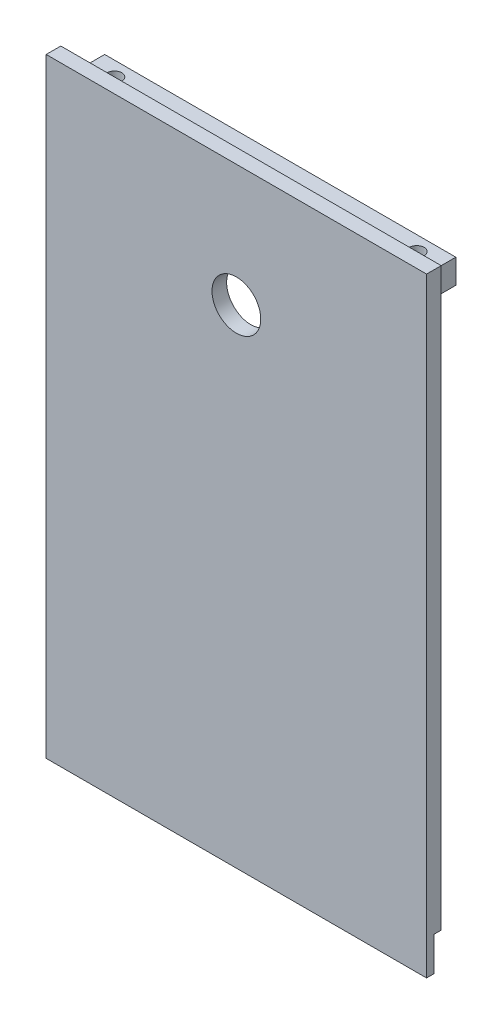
ISO-10303-21;
HEADER;
FILE_DESCRIPTION(('STEP AP214'),'2;1');
FILE_NAME('part.step','',(''),(''),'','','');
FILE_SCHEMA(('AUTOMOTIVE_DESIGN { 1 0 10303 214 1 1 1 1 }'));
ENDSEC;
DATA;
#1=APPLICATION_CONTEXT('core data for automotive mechanical design processes');
#2=APPLICATION_PROTOCOL_DEFINITION('international standard','automotive_design',2000,#1);
#3=PRODUCT_CONTEXT('',#1,'mechanical');
#4=PRODUCT('Part','Part','',(#3));
#5=PRODUCT_RELATED_PRODUCT_CATEGORY('part','',(#4));
#6=PRODUCT_DEFINITION_FORMATION('','',#4);
#7=PRODUCT_DEFINITION_CONTEXT('part definition',#1,'design');
#8=PRODUCT_DEFINITION('design','',#6,#7);
#9=PRODUCT_DEFINITION_SHAPE('','',#8);
#10=(LENGTH_UNIT() NAMED_UNIT(*) SI_UNIT(.MILLI.,.METRE.));
#11=(NAMED_UNIT(*) PLANE_ANGLE_UNIT() SI_UNIT($,.RADIAN.));
#12=(NAMED_UNIT(*) SI_UNIT($,.STERADIAN.) SOLID_ANGLE_UNIT());
#13=UNCERTAINTY_MEASURE_WITH_UNIT(LENGTH_MEASURE(1.E-05),#10,'distance_accuracy_value','');
#14=(GEOMETRIC_REPRESENTATION_CONTEXT(3) GLOBAL_UNCERTAINTY_ASSIGNED_CONTEXT((#13)) GLOBAL_UNIT_ASSIGNED_CONTEXT((#10,
#11,#12)) REPRESENTATION_CONTEXT('',''));
#15=CARTESIAN_POINT('',(0.,0.,0.));
#16=DIRECTION('',(0.,0.,1.));
#17=DIRECTION('',(1.,0.,0.));
#18=AXIS2_PLACEMENT_3D('',#15,#16,#17);
#19=CARTESIAN_POINT('',(39.,124.5,3.));
#20=DIRECTION('',(-1.,0.,0.));
#21=DIRECTION('',(0.,-1.,0.));
#22=AXIS2_PLACEMENT_3D('',#19,#20,#21);
#23=PLANE('',#22);
#24=DIRECTION('',(0.,1.,0.));
#25=VECTOR('',#24,1.);
#26=CARTESIAN_POINT('',(39.,6.50000000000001,1.5));
#27=LINE('',#26,#25);
#28=CARTESIAN_POINT('',(39.,-0.499999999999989,1.5));
#29=VERTEX_POINT('',#28);
#30=CARTESIAN_POINT('',(39.,6.50000000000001,1.5));
#31=VERTEX_POINT('',#30);
#32=EDGE_CURVE('E124',#29,#31,#27,.T.);
#33=ORIENTED_EDGE('',*,*,#32,.T.);
#34=DIRECTION('',(0.,0.,-1.));
#35=VECTOR('',#34,1.);
#36=CARTESIAN_POINT('',(39.,6.50000000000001,0.));
#37=LINE('',#36,#35);
#38=CARTESIAN_POINT('',(39.,6.50000000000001,0.));
#39=VERTEX_POINT('',#38);
#40=EDGE_CURVE('E134',#31,#39,#37,.T.);
#41=ORIENTED_EDGE('',*,*,#40,.T.);
#42=DIRECTION('',(0.,1.,0.));
#43=VECTOR('',#42,1.);
#44=CARTESIAN_POINT('',(39.,124.5,0.));
#45=LINE('',#44,#43);
#46=CARTESIAN_POINT('',(39.,124.5,0.));
#47=VERTEX_POINT('',#46);
#48=EDGE_CURVE('E149',#39,#47,#45,.T.);
#49=ORIENTED_EDGE('',*,*,#48,.T.);
#50=DIRECTION('',(0.,0.,-1.));
#51=VECTOR('',#50,1.);
#52=CARTESIAN_POINT('',(39.,124.5,3.));
#53=LINE('',#52,#51);
#54=CARTESIAN_POINT('',(39.,124.5,3.));
#55=VERTEX_POINT('',#54);
#56=EDGE_CURVE('E11',#55,#47,#53,.T.);
#57=ORIENTED_EDGE('',*,*,#56,.F.);
#58=DIRECTION('',(0.,1.,0.));
#59=VECTOR('',#58,1.);
#60=CARTESIAN_POINT('',(39.,124.5,3.));
#61=LINE('',#60,#59);
#62=CARTESIAN_POINT('',(39.,-0.499999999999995,3.));
#63=VERTEX_POINT('',#62);
#64=EDGE_CURVE('E130',#63,#55,#61,.T.);
#65=ORIENTED_EDGE('',*,*,#64,.F.);
#66=DIRECTION('',(0.,0.,-1.));
#67=VECTOR('',#66,1.);
#68=CARTESIAN_POINT('',(39.,-0.499999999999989,1.5));
#69=LINE('',#68,#67);
#70=EDGE_CURVE('E113',#63,#29,#69,.T.);
#71=ORIENTED_EDGE('',*,*,#70,.T.);
#72=EDGE_LOOP('',(#33,#41,#49,#57,#65,#71));
#73=FACE_BOUND('',#72,.T.);
#74=ADVANCED_FACE('F37',(#73),#23,.F.);
#75=CARTESIAN_POINT('',(-39.,124.5,3.));
#76=DIRECTION('',(0.,-1.,0.));
#77=DIRECTION('',(0.,0.,-1.));
#78=AXIS2_PLACEMENT_3D('',#75,#76,#77);
#79=PLANE('',#78);
#80=DIRECTION('',(-1.,0.,0.));
#81=VECTOR('',#80,1.);
#82=CARTESIAN_POINT('',(-39.,124.5,0.));
#83=LINE('',#82,#81);
#84=CARTESIAN_POINT('',(-39.,124.5,0.));
#85=VERTEX_POINT('',#84);
#86=EDGE_CURVE('E142',#47,#85,#83,.T.);
#87=ORIENTED_EDGE('',*,*,#86,.T.);
#88=DIRECTION('',(0.,0.,-1.));
#89=VECTOR('',#88,1.);
#90=CARTESIAN_POINT('',(-39.,124.5,3.));
#91=LINE('',#90,#89);
#92=CARTESIAN_POINT('',(-39.,124.5,3.));
#93=VERTEX_POINT('',#92);
#94=EDGE_CURVE('E45',#93,#85,#91,.T.);
#95=ORIENTED_EDGE('',*,*,#94,.F.);
#96=DIRECTION('',(-1.,0.,0.));
#97=VECTOR('',#96,1.);
#98=CARTESIAN_POINT('',(-39.,124.5,3.));
#99=LINE('',#98,#97);
#100=EDGE_CURVE('E137',#55,#93,#99,.T.);
#101=ORIENTED_EDGE('',*,*,#100,.F.);
#102=ORIENTED_EDGE('',*,*,#56,.T.);
#103=EDGE_LOOP('',(#87,#95,#101,#102));
#104=FACE_BOUND('',#103,.T.);
#105=ADVANCED_FACE('F241',(#104),#79,.F.);
#106=CARTESIAN_POINT('',(-39.,124.5,3.));
#107=DIRECTION('',(1.,0.,0.));
#108=DIRECTION('',(0.,1.,0.));
#109=AXIS2_PLACEMENT_3D('',#106,#107,#108);
#110=PLANE('',#109);
#111=DIRECTION('',(0.,-1.,0.));
#112=VECTOR('',#111,1.);
#113=CARTESIAN_POINT('',(-39.,124.5,0.));
#114=LINE('',#113,#112);
#115=CARTESIAN_POINT('',(-39.,6.50000000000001,0.));
#116=VERTEX_POINT('',#115);
#117=EDGE_CURVE('E138',#85,#116,#114,.T.);
#118=ORIENTED_EDGE('',*,*,#117,.T.);
#119=DIRECTION('',(0.,0.,-1.));
#120=VECTOR('',#119,1.);
#121=CARTESIAN_POINT('',(-39.,6.5,0.));
#122=LINE('',#121,#120);
#123=CARTESIAN_POINT('',(-39.,6.5,1.5));
#124=VERTEX_POINT('',#123);
#125=EDGE_CURVE('E52',#124,#116,#122,.T.);
#126=ORIENTED_EDGE('',*,*,#125,.F.);
#127=DIRECTION('',(0.,1.,0.));
#128=VECTOR('',#127,1.);
#129=CARTESIAN_POINT('',(-39.,6.5,1.5));
#130=LINE('',#129,#128);
#131=CARTESIAN_POINT('',(-39.,-0.5,1.5));
#132=VERTEX_POINT('',#131);
#133=EDGE_CURVE('E415',#132,#124,#130,.T.);
#134=ORIENTED_EDGE('',*,*,#133,.F.);
#135=DIRECTION('',(0.,0.,-1.));
#136=VECTOR('',#135,1.);
#137=CARTESIAN_POINT('',(-39.,-0.5,1.5));
#138=LINE('',#137,#136);
#139=CARTESIAN_POINT('',(-39.,-0.500000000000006,3.));
#140=VERTEX_POINT('',#139);
#141=EDGE_CURVE('E416',#140,#132,#138,.T.);
#142=ORIENTED_EDGE('',*,*,#141,.F.);
#143=DIRECTION('',(0.,-1.,0.));
#144=VECTOR('',#143,1.);
#145=CARTESIAN_POINT('',(-39.,124.5,3.));
#146=LINE('',#145,#144);
#147=EDGE_CURVE('E133',#93,#140,#146,.T.);
#148=ORIENTED_EDGE('',*,*,#147,.F.);
#149=ORIENTED_EDGE('',*,*,#94,.T.);
#150=EDGE_LOOP('',(#118,#126,#134,#142,#148,#149));
#151=FACE_BOUND('',#150,.T.);
#152=ADVANCED_FACE('F157',(#151),#110,.F.);
#153=CARTESIAN_POINT('',(0.,0.,3.));
#154=DIRECTION('',(0.,0.,1.));
#155=DIRECTION('',(1.,0.,0.));
#156=AXIS2_PLACEMENT_3D('',#153,#154,#155);
#157=PLANE('',#156);
#158=DIRECTION('',(-1.,0.,0.));
#159=VECTOR('',#158,1.);
#160=CARTESIAN_POINT('',(39.,-0.499999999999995,3.));
#161=LINE('',#160,#159);
#162=EDGE_CURVE('E117',#63,#140,#161,.T.);
#163=ORIENTED_EDGE('',*,*,#162,.F.);
#164=ORIENTED_EDGE('',*,*,#64,.T.);
#165=ORIENTED_EDGE('',*,*,#100,.T.);
#166=ORIENTED_EDGE('',*,*,#147,.T.);
#167=EDGE_LOOP('',(#163,#164,#165,#166));
#168=FACE_BOUND('',#167,.T.);
#169=CARTESIAN_POINT('',(0.,99.5,3.));
#170=DIRECTION('',(0.,0.,1.));
#171=DIRECTION('',(1.,0.,0.));
#172=AXIS2_PLACEMENT_3D('',#169,#170,#171);
#173=CIRCLE('',#172,5.00000000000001);
#174=CARTESIAN_POINT('',(5.00000000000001,99.5,3.));
#175=VERTEX_POINT('',#174);
#176=EDGE_CURVE('E166',#175,#175,#173,.T.);
#177=ORIENTED_EDGE('',*,*,#176,.F.);
#178=EDGE_LOOP('',(#177));
#179=FACE_BOUND('',#178,.T.);
#180=ADVANCED_FACE('F128',(#168,#179),#157,.T.);
#181=CARTESIAN_POINT('',(0.,0.,0.));
#182=DIRECTION('',(0.,0.,1.));
#183=DIRECTION('',(1.,0.,0.));
#184=AXIS2_PLACEMENT_3D('',#181,#182,#183);
#185=PLANE('',#184);
#186=CARTESIAN_POINT('',(0.,99.5,0.));
#187=DIRECTION('',(0.,0.,1.));
#188=DIRECTION('',(1.,0.,0.));
#189=AXIS2_PLACEMENT_3D('',#186,#187,#188);
#190=CIRCLE('',#189,5.00000000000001);
#191=CARTESIAN_POINT('',(5.00000000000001,99.5,0.));
#192=VERTEX_POINT('',#191);
#193=EDGE_CURVE('E40',#192,#192,#190,.T.);
#194=ORIENTED_EDGE('',*,*,#193,.T.);
#195=EDGE_LOOP('',(#194));
#196=FACE_BOUND('',#195,.T.);
#197=DIRECTION('',(0.,-1.,0.));
#198=VECTOR('',#197,1.);
#199=CARTESIAN_POINT('',(-36.,124.5,0.));
#200=LINE('',#199,#198);
#201=CARTESIAN_POINT('',(-36.,121.5,0.));
#202=VERTEX_POINT('',#201);
#203=CARTESIAN_POINT('',(-36.,116.5,0.));
#204=VERTEX_POINT('',#203);
#205=EDGE_CURVE('E189',#202,#204,#200,.T.);
#206=ORIENTED_EDGE('',*,*,#205,.T.);
#207=DIRECTION('',(-1.,0.,0.));
#208=VECTOR('',#207,1.);
#209=CARTESIAN_POINT('',(39.,116.5,0.));
#210=LINE('',#209,#208);
#211=CARTESIAN_POINT('',(36.,116.5,0.));
#212=VERTEX_POINT('',#211);
#213=EDGE_CURVE('E151',#212,#204,#210,.T.);
#214=ORIENTED_EDGE('',*,*,#213,.F.);
#215=DIRECTION('',(0.,-1.,0.));
#216=VECTOR('',#215,1.);
#217=CARTESIAN_POINT('',(36.,124.5,0.));
#218=LINE('',#217,#216);
#219=CARTESIAN_POINT('',(36.,121.5,0.));
#220=VERTEX_POINT('',#219);
#221=EDGE_CURVE('E60',#220,#212,#218,.T.);
#222=ORIENTED_EDGE('',*,*,#221,.F.);
#223=DIRECTION('',(-1.,0.,0.));
#224=VECTOR('',#223,1.);
#225=CARTESIAN_POINT('',(39.,121.5,0.));
#226=LINE('',#225,#224);
#227=EDGE_CURVE('E145',#220,#202,#226,.T.);
#228=ORIENTED_EDGE('',*,*,#227,.T.);
#229=EDGE_LOOP('',(#206,#214,#222,#228));
#230=FACE_BOUND('',#229,.T.);
#231=ORIENTED_EDGE('',*,*,#48,.F.);
#232=DIRECTION('',(-1.,0.,0.));
#233=VECTOR('',#232,1.);
#234=CARTESIAN_POINT('',(39.,6.50000000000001,0.));
#235=LINE('',#234,#233);
#236=EDGE_CURVE('E163',#39,#116,#235,.T.);
#237=ORIENTED_EDGE('',*,*,#236,.T.);
#238=ORIENTED_EDGE('',*,*,#117,.F.);
#239=ORIENTED_EDGE('',*,*,#86,.F.);
#240=EDGE_LOOP('',(#231,#237,#238,#239));
#241=FACE_BOUND('',#240,.T.);
#242=ADVANCED_FACE('F162',(#196,#230,#241),#185,.F.);
#243=CARTESIAN_POINT('',(39.,121.5,-6.));
#244=DIRECTION('',(0.,0.,-1.));
#245=DIRECTION('',(0.,1.,0.));
#246=AXIS2_PLACEMENT_3D('',#243,#244,#245);
#247=PLANE('',#246);
#248=DIRECTION('',(0.,-1.,0.));
#249=VECTOR('',#248,1.);
#250=CARTESIAN_POINT('',(-36.,124.5,-6.));
#251=LINE('',#250,#249);
#252=CARTESIAN_POINT('',(-36.,121.5,-6.));
#253=VERTEX_POINT('',#252);
#254=CARTESIAN_POINT('',(-36.,116.5,-6.));
#255=VERTEX_POINT('',#254);
#256=EDGE_CURVE('E193',#253,#255,#251,.T.);
#257=ORIENTED_EDGE('',*,*,#256,.F.);
#258=DIRECTION('',(-1.,0.,0.));
#259=VECTOR('',#258,1.);
#260=CARTESIAN_POINT('',(39.,121.5,-6.));
#261=LINE('',#260,#259);
#262=CARTESIAN_POINT('',(36.,121.5,-6.));
#263=VERTEX_POINT('',#262);
#264=EDGE_CURVE('E209',#263,#253,#261,.T.);
#265=ORIENTED_EDGE('',*,*,#264,.F.);
#266=DIRECTION('',(0.,-1.,0.));
#267=VECTOR('',#266,1.);
#268=CARTESIAN_POINT('',(36.,124.5,-6.));
#269=LINE('',#268,#267);
#270=CARTESIAN_POINT('',(36.,116.5,-6.));
#271=VERTEX_POINT('',#270);
#272=EDGE_CURVE('E188',#263,#271,#269,.T.);
#273=ORIENTED_EDGE('',*,*,#272,.T.);
#274=DIRECTION('',(-1.,0.,0.));
#275=VECTOR('',#274,1.);
#276=CARTESIAN_POINT('',(39.,116.5,-6.));
#277=LINE('',#276,#275);
#278=EDGE_CURVE('E207',#271,#255,#277,.T.);
#279=ORIENTED_EDGE('',*,*,#278,.T.);
#280=EDGE_LOOP('',(#257,#265,#273,#279));
#281=FACE_BOUND('',#280,.T.);
#282=ADVANCED_FACE('F225',(#281),#247,.T.);
#283=CARTESIAN_POINT('',(39.,121.5,0.));
#284=DIRECTION('',(0.,1.,0.));
#285=DIRECTION('',(-1.,0.,0.));
#286=AXIS2_PLACEMENT_3D('',#283,#284,#285);
#287=PLANE('',#286);
#288=CARTESIAN_POINT('',(-31.,121.5,-3.));
#289=DIRECTION('',(0.,1.,0.));
#290=DIRECTION('',(-1.,0.,0.));
#291=AXIS2_PLACEMENT_3D('',#288,#289,#290);
#292=CIRCLE('',#291,1.5);
#293=CARTESIAN_POINT('',(-32.5,121.5,-3.));
#294=VERTEX_POINT('',#293);
#295=EDGE_CURVE('E185',#294,#294,#292,.T.);
#296=ORIENTED_EDGE('',*,*,#295,.F.);
#297=EDGE_LOOP('',(#296));
#298=FACE_BOUND('',#297,.T.);
#299=CARTESIAN_POINT('',(31.,121.5,-3.));
#300=DIRECTION('',(0.,1.,0.));
#301=DIRECTION('',(-1.,0.,0.));
#302=AXIS2_PLACEMENT_3D('',#299,#300,#301);
#303=CIRCLE('',#302,1.5);
#304=CARTESIAN_POINT('',(29.5,121.5,-3.));
#305=VERTEX_POINT('',#304);
#306=EDGE_CURVE('E179',#305,#305,#303,.T.);
#307=ORIENTED_EDGE('',*,*,#306,.F.);
#308=EDGE_LOOP('',(#307));
#309=FACE_BOUND('',#308,.T.);
#310=DIRECTION('',(0.,0.,-1.));
#311=VECTOR('',#310,1.);
#312=CARTESIAN_POINT('',(-36.,121.5,0.));
#313=LINE('',#312,#311);
#314=EDGE_CURVE('E203',#202,#253,#313,.T.);
#315=ORIENTED_EDGE('',*,*,#314,.F.);
#316=ORIENTED_EDGE('',*,*,#227,.F.);
#317=DIRECTION('',(0.,0.,1.));
#318=VECTOR('',#317,1.);
#319=CARTESIAN_POINT('',(36.,121.5,0.));
#320=LINE('',#319,#318);
#321=EDGE_CURVE('E199',#263,#220,#320,.T.);
#322=ORIENTED_EDGE('',*,*,#321,.F.);
#323=ORIENTED_EDGE('',*,*,#264,.T.);
#324=EDGE_LOOP('',(#315,#316,#322,#323));
#325=FACE_BOUND('',#324,.T.);
#326=ADVANCED_FACE('F219',(#298,#309,#325),#287,.T.);
#327=CARTESIAN_POINT('',(39.,116.5,-6.));
#328=DIRECTION('',(0.,-1.,0.));
#329=DIRECTION('',(1.,0.,0.));
#330=AXIS2_PLACEMENT_3D('',#327,#328,#329);
#331=PLANE('',#330);
#332=CARTESIAN_POINT('',(-31.,116.5,-3.));
#333=DIRECTION('',(0.,-1.,0.));
#334=DIRECTION('',(1.,0.,0.));
#335=AXIS2_PLACEMENT_3D('',#332,#333,#334);
#336=CIRCLE('',#335,1.5);
#337=CARTESIAN_POINT('',(-29.5,116.5,-3.));
#338=VERTEX_POINT('',#337);
#339=EDGE_CURVE('E182',#338,#338,#336,.T.);
#340=ORIENTED_EDGE('',*,*,#339,.F.);
#341=EDGE_LOOP('',(#340));
#342=FACE_BOUND('',#341,.T.);
#343=CARTESIAN_POINT('',(31.,116.5,-3.));
#344=DIRECTION('',(0.,-1.,0.));
#345=DIRECTION('',(1.,0.,0.));
#346=AXIS2_PLACEMENT_3D('',#343,#344,#345);
#347=CIRCLE('',#346,1.5);
#348=CARTESIAN_POINT('',(32.5,116.5,-3.));
#349=VERTEX_POINT('',#348);
#350=EDGE_CURVE('E176',#349,#349,#347,.T.);
#351=ORIENTED_EDGE('',*,*,#350,.F.);
#352=EDGE_LOOP('',(#351));
#353=FACE_BOUND('',#352,.T.);
#354=DIRECTION('',(0.,0.,1.));
#355=VECTOR('',#354,1.);
#356=CARTESIAN_POINT('',(-36.,116.5,-6.));
#357=LINE('',#356,#355);
#358=EDGE_CURVE('E201',#255,#204,#357,.T.);
#359=ORIENTED_EDGE('',*,*,#358,.F.);
#360=ORIENTED_EDGE('',*,*,#278,.F.);
#361=DIRECTION('',(0.,0.,-1.));
#362=VECTOR('',#361,1.);
#363=CARTESIAN_POINT('',(36.,116.5,-6.));
#364=LINE('',#363,#362);
#365=EDGE_CURVE('E192',#212,#271,#364,.T.);
#366=ORIENTED_EDGE('',*,*,#365,.F.);
#367=ORIENTED_EDGE('',*,*,#213,.T.);
#368=EDGE_LOOP('',(#359,#360,#366,#367));
#369=FACE_BOUND('',#368,.T.);
#370=ADVANCED_FACE('F228',(#342,#353,#369),#331,.T.);
#371=CARTESIAN_POINT('',(36.,124.5,-6.));
#372=DIRECTION('',(-1.,0.,0.));
#373=DIRECTION('',(0.,-1.,0.));
#374=AXIS2_PLACEMENT_3D('',#371,#372,#373);
#375=PLANE('',#374);
#376=ORIENTED_EDGE('',*,*,#321,.T.);
#377=ORIENTED_EDGE('',*,*,#221,.T.);
#378=ORIENTED_EDGE('',*,*,#365,.T.);
#379=ORIENTED_EDGE('',*,*,#272,.F.);
#380=EDGE_LOOP('',(#376,#377,#378,#379));
#381=FACE_BOUND('',#380,.T.);
#382=ADVANCED_FACE('F229',(#381),#375,.F.);
#383=CARTESIAN_POINT('',(-36.,124.5,0.));
#384=DIRECTION('',(1.,0.,0.));
#385=DIRECTION('',(0.,1.,0.));
#386=AXIS2_PLACEMENT_3D('',#383,#384,#385);
#387=PLANE('',#386);
#388=ORIENTED_EDGE('',*,*,#314,.T.);
#389=ORIENTED_EDGE('',*,*,#256,.T.);
#390=ORIENTED_EDGE('',*,*,#358,.T.);
#391=ORIENTED_EDGE('',*,*,#205,.F.);
#392=EDGE_LOOP('',(#388,#389,#390,#391));
#393=FACE_BOUND('',#392,.T.);
#394=ADVANCED_FACE('F222',(#393),#387,.F.);
#395=CARTESIAN_POINT('',(31.,124.5,-3.));
#396=DIRECTION('',(0.,-1.,0.));
#397=DIRECTION('',(1.,0.,0.));
#398=AXIS2_PLACEMENT_3D('',#395,#396,#397);
#399=CYLINDRICAL_SURFACE('',#398,1.5);
#400=ORIENTED_EDGE('',*,*,#306,.T.);
#401=EDGE_LOOP('',(#400));
#402=FACE_BOUND('',#401,.T.);
#403=ORIENTED_EDGE('',*,*,#350,.T.);
#404=EDGE_LOOP('',(#403));
#405=FACE_BOUND('',#404,.T.);
#406=ADVANCED_FACE('F236',(#402,#405),#399,.F.);
#407=CARTESIAN_POINT('',(-31.,124.5,-3.));
#408=DIRECTION('',(0.,-1.,0.));
#409=DIRECTION('',(1.,0.,0.));
#410=AXIS2_PLACEMENT_3D('',#407,#408,#409);
#411=CYLINDRICAL_SURFACE('',#410,1.5);
#412=ORIENTED_EDGE('',*,*,#295,.T.);
#413=EDGE_LOOP('',(#412));
#414=FACE_BOUND('',#413,.T.);
#415=ORIENTED_EDGE('',*,*,#339,.T.);
#416=EDGE_LOOP('',(#415));
#417=FACE_BOUND('',#416,.T.);
#418=ADVANCED_FACE('F283',(#414,#417),#411,.F.);
#419=CARTESIAN_POINT('',(0.,99.5,-6.));
#420=DIRECTION('',(0.,0.,1.));
#421=DIRECTION('',(1.,0.,0.));
#422=AXIS2_PLACEMENT_3D('',#419,#420,#421);
#423=CYLINDRICAL_SURFACE('',#422,5.00000000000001);
#424=ORIENTED_EDGE('',*,*,#176,.T.);
#425=EDGE_LOOP('',(#424));
#426=FACE_BOUND('',#425,.T.);
#427=ORIENTED_EDGE('',*,*,#193,.F.);
#428=EDGE_LOOP('',(#427));
#429=FACE_BOUND('',#428,.T.);
#430=ADVANCED_FACE('F295',(#426,#429),#423,.F.);
#431=CARTESIAN_POINT('',(39.,6.50000000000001,0.));
#432=DIRECTION('',(0.,1.,0.));
#433=DIRECTION('',(-1.,0.,0.));
#434=AXIS2_PLACEMENT_3D('',#431,#432,#433);
#435=PLANE('',#434);
#436=ORIENTED_EDGE('',*,*,#125,.T.);
#437=ORIENTED_EDGE('',*,*,#236,.F.);
#438=ORIENTED_EDGE('',*,*,#40,.F.);
#439=DIRECTION('',(-1.,0.,0.));
#440=VECTOR('',#439,1.);
#441=CARTESIAN_POINT('',(39.,6.50000000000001,1.5));
#442=LINE('',#441,#440);
#443=EDGE_CURVE('E167',#31,#124,#442,.T.);
#444=ORIENTED_EDGE('',*,*,#443,.T.);
#445=EDGE_LOOP('',(#436,#437,#438,#444));
#446=FACE_BOUND('',#445,.T.);
#447=ADVANCED_FACE('F305',(#446),#435,.F.);
#448=CARTESIAN_POINT('',(39.,6.50000000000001,1.5));
#449=DIRECTION('',(0.,0.,1.));
#450=DIRECTION('',(0.,-1.,0.));
#451=AXIS2_PLACEMENT_3D('',#448,#449,#450);
#452=PLANE('',#451);
#453=ORIENTED_EDGE('',*,*,#133,.T.);
#454=ORIENTED_EDGE('',*,*,#443,.F.);
#455=ORIENTED_EDGE('',*,*,#32,.F.);
#456=DIRECTION('',(-1.,0.,0.));
#457=VECTOR('',#456,1.);
#458=CARTESIAN_POINT('',(39.,-0.499999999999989,1.5));
#459=LINE('',#458,#457);
#460=EDGE_CURVE('E119',#29,#132,#459,.T.);
#461=ORIENTED_EDGE('',*,*,#460,.T.);
#462=EDGE_LOOP('',(#453,#454,#455,#461));
#463=FACE_BOUND('',#462,.T.);
#464=ADVANCED_FACE('F342',(#463),#452,.F.);
#465=CARTESIAN_POINT('',(39.,-0.499999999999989,1.5));
#466=DIRECTION('',(0.,1.,0.));
#467=DIRECTION('',(0.,0.,1.));
#468=AXIS2_PLACEMENT_3D('',#465,#466,#467);
#469=PLANE('',#468);
#470=ORIENTED_EDGE('',*,*,#141,.T.);
#471=ORIENTED_EDGE('',*,*,#460,.F.);
#472=ORIENTED_EDGE('',*,*,#70,.F.);
#473=ORIENTED_EDGE('',*,*,#162,.T.);
#474=EDGE_LOOP('',(#470,#471,#472,#473));
#475=FACE_BOUND('',#474,.T.);
#476=ADVANCED_FACE('F116',(#475),#469,.F.);
#477=CLOSED_SHELL('',(#74,#105,#152,#180,#242,#282,#326,#370,#382,#394,#406,#418,#430,#447,#464,#476));
#478=MANIFOLD_SOLID_BREP('B2',#477);
#479=ADVANCED_BREP_SHAPE_REPRESENTATION('',(#18,#478),#14);
#480=SHAPE_DEFINITION_REPRESENTATION(#9,#479);
ENDSEC;
END-ISO-10303-21;
